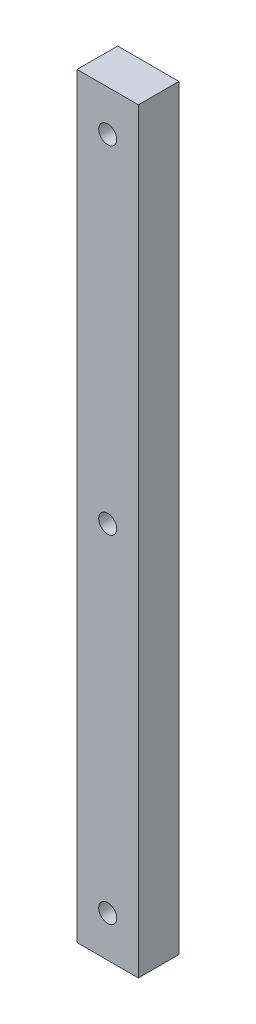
from build123d import *

# Parameters (mm, degrees)
SKETCH1_W                                           = 19.05
SKETCH1_H                                           = 234.95
BOSS_EXTRUDE1_DEPTH                                 = 12.5984
CBORE_FOR_10_BINDING_HEAD_MACHINE_SCREW_D           = 5.6134
CBORE_FOR_10_BINDING_HEAD_MACHINE_SCREW_CBORE_D     = 11.1125
CBORE_FOR_10_BINDING_HEAD_MACHINE_SCREW_CBORE_DEPTH = 3.1242
F_10_CLEARANCE_HOLE1_D                              = 5.6134


with BuildPart() as part:
    # Sketch1 → Boss-Extrude1 (new body)
    with BuildSketch(Plane.XY):
        with Locations((-215.9, 0)):
            Rectangle(SKETCH1_W, SKETCH1_H)
    extrude(amount=BOSS_EXTRUDE1_DEPTH)

    # CBORE for _10 Binding Head Machine Screw (through all)
    with Locations(Plane(origin=(0, 0, 0), x_dir=(-1, 0, 0), z_dir=(0, 0, -1))):
        with Locations((215.9, 0)):
            CounterBoreHole(CBORE_FOR_10_BINDING_HEAD_MACHINE_SCREW_D / 2, CBORE_FOR_10_BINDING_HEAD_MACHINE_SCREW_CBORE_D / 2, CBORE_FOR_10_BINDING_HEAD_MACHINE_SCREW_CBORE_DEPTH)

    # 10 Clearance Hole1 (through all)
    with Locations(Plane(origin=(0, 0, 0), x_dir=(-1, 0, 0), z_dir=(0, 0, -1))):
        with Locations((215.9, 104.775), (215.9, -104.775)):
            Hole(F_10_CLEARANCE_HOLE1_D / 2)


solid = part.part
